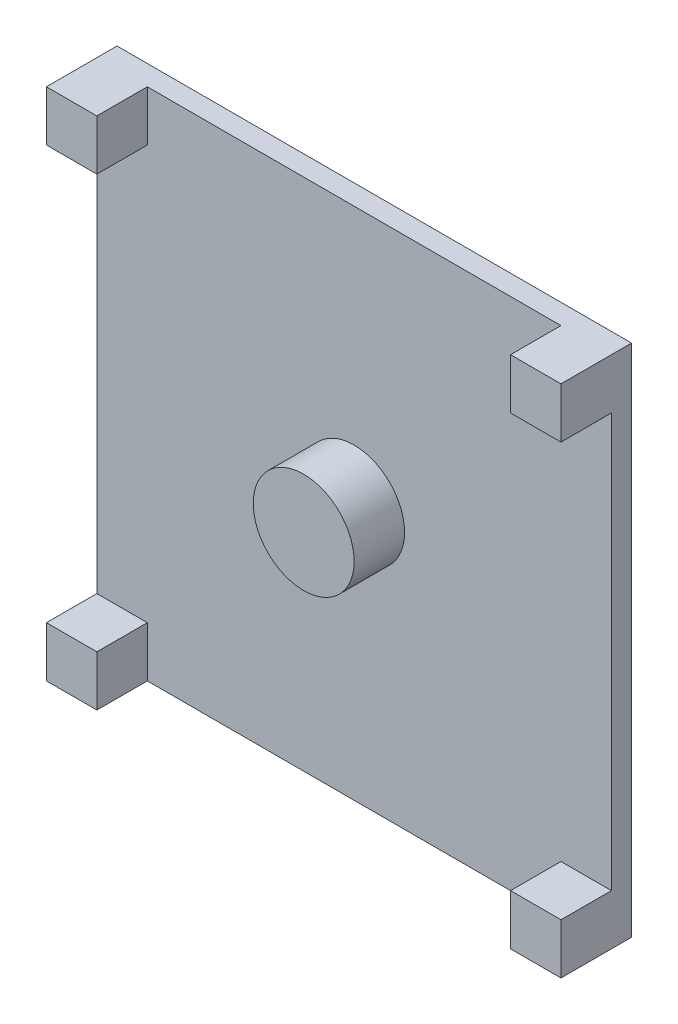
from build123d import *

# Parameters (mm, degrees)
ESQUISSE1_W        = 510
ESQUISSE1_H        = 510
EXTRUSION1_DEPTH   = 20
ESQUISSE2_R        = 50
ESQUISSE2_W        = 50
ESQUISSE2_H        = 50
BOSS_EXTRU_1_DEPTH = 50


with BuildPart() as part:
    # Esquisse1 → Extrusion1 (new body)
    with BuildSketch(Plane.XY):
        with Locations((209.378785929, -221.118135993)):
            Rectangle(ESQUISSE1_W, ESQUISSE1_H)
    extrude(amount=EXTRUSION1_DEPTH)

    # Esquisse2 → Boss.-Extru.1 (add)
    with BuildSketch(Plane.XY.offset(20)):
        with Locations((209.378785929, -221.118135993)):
            Circle(ESQUISSE2_R)
        with Locations((-20.621214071, 8.881864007)):
            Rectangle(ESQUISSE2_W, ESQUISSE2_H)
        with Locations((439.378785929, 8.881864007)):
            Rectangle(ESQUISSE2_W, ESQUISSE2_H)
        with Locations((-20.621214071, -451.118135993)):
            Rectangle(ESQUISSE2_W, ESQUISSE2_H)
        with Locations((439.378785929, -451.118135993)):
            Rectangle(ESQUISSE2_W, ESQUISSE2_H)
    extrude(amount=BOSS_EXTRU_1_DEPTH)


solid = part.part
